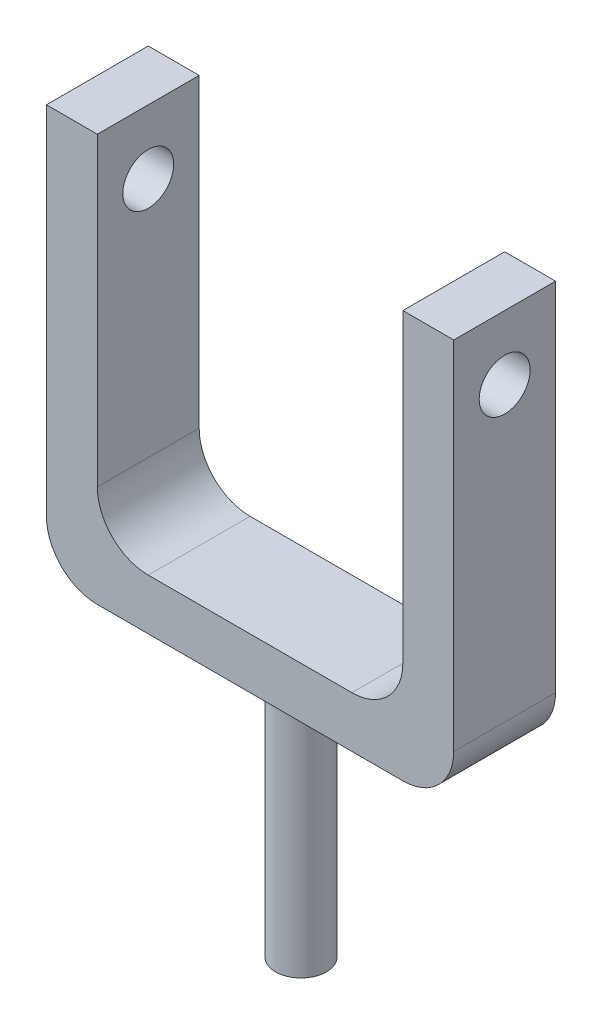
from build123d import *

# Parameters (mm, degrees)
EXTRUDE1_DEPTH                 = 12.7
SKETCH2_R                      = 6.35
EXTRUDE2_DEPTH                 = 63.5
CUT_EXTRUDE1_REACH             = 116.3
SKETCH3_R                      = 6.35
CUT_EXTRUDE1_DIRECTION_2_REACH = 116.3


with BuildPart() as part:
    # Sketch1 → Extrude1 (new, symmetric)
    with BuildSketch(Plane.XY):
        with BuildLine():
            Line((-38.1, 0), (38.1, 0))
            ThreePointArc((38.1, 0), (47.080256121, 3.719743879), (50.8, 12.7))
            Line((50.8, 12.7), (50.8, 101.6))
            Line((50.8, 101.6), (38.1, 101.6))
            Line((38.1, 101.6), (38.1, 25.4))
            ThreePointArc((38.1, 25.4), (34.380256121, 16.419743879), (25.4, 12.7))
            Line((25.4, 12.7), (-25.4, 12.7))
            ThreePointArc((-25.4, 12.7), (-34.380256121, 16.419743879), (-38.1, 25.4))
            Line((-38.1, 25.4), (-38.1, 101.6))
            Line((-38.1, 101.6), (-50.8, 101.6))
            Line((-50.8, 101.6), (-50.8, 12.7))
            ThreePointArc((-50.8, 12.7), (-47.080256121, 3.719743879), (-38.1, 0))
        make_face()
    extrude(amount=EXTRUDE1_DEPTH, both=True)

    # Sketch2 → Extrude2 (add)
    with BuildSketch(Plane(origin=(0, 0, 0), x_dir=(1, 0, 0), z_dir=(0, 1, 0))):
        with Locations(Location((0, 0, 0), (0, 0, 270))):
            Circle(SKETCH2_R)
    extrude(amount=-EXTRUDE2_DEPTH)

    # Cut-Extrude1: up to this face of the body (flat: up to its plane)
    cut_extrude1_end = Plane(part.part.faces().sort_by_distance((-50.8, 57.15, 0))[0])
    # Sketch3 → Cut-Extrude1 (cut, up to the picked face)
    with BuildSketch(Plane(origin=(0, 0, 0), x_dir=(0, 0, -1), z_dir=(1, 0, 0)), mode=Mode.PRIVATE) as cut_extrude1_sk1:
        with Locations(Location((0, 85.598, 0), (0, 0, 90))):
            Circle(SKETCH3_R)
    cut_extrude1_tool1 = split(extrude(cut_extrude1_sk1.sketch, amount=-CUT_EXTRUDE1_REACH, mode=Mode.PRIVATE), bisect_by=cut_extrude1_end, keep=Keep.BOTH, mode=Mode.PRIVATE)
    add(cut_extrude1_tool1.solids().sort_by(Axis((0, 85.598, 0), (-1, 0, 0)))[0], mode=Mode.SUBTRACT)

    # Cut-Extrude1 direction 2: up to this face of the body (flat: up to its plane)
    cut_extrude1_direction_2_end = Plane(part.part.faces().sort_by_distance((50.8, 57.15, 0))[0])
    # Sketch3 → Cut-Extrude1 direction 2 (cut, up to the picked face)
    with BuildSketch(Plane(origin=(0, 0, 0), x_dir=(0, 0, -1), z_dir=(1, 0, 0)), mode=Mode.PRIVATE) as cut_extrude1_direction_2_sk1:
        with Locations(Location((0, 85.598, 0), (0, 0, 90))):
            Circle(SKETCH3_R)
    cut_extrude1_direction_2_tool1 = split(extrude(cut_extrude1_direction_2_sk1.sketch, amount=CUT_EXTRUDE1_DIRECTION_2_REACH, mode=Mode.PRIVATE), bisect_by=cut_extrude1_direction_2_end, keep=Keep.BOTH, mode=Mode.PRIVATE)
    add(cut_extrude1_direction_2_tool1.solids().sort_by(Axis((0, 85.598, 0), (1, 0, 0)))[0], mode=Mode.SUBTRACT)


solid = part.part
